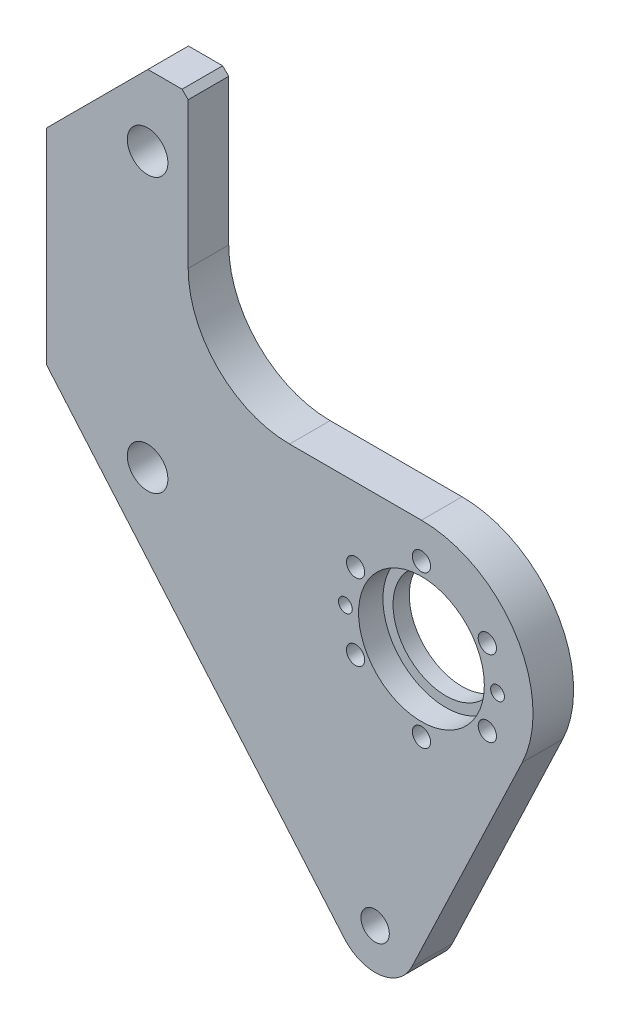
ISO-10303-21;
HEADER;
FILE_DESCRIPTION(('STEP AP214'),'2;1');
FILE_NAME('part.step','',(''),(''),'','','');
FILE_SCHEMA(('AUTOMOTIVE_DESIGN { 1 0 10303 214 1 1 1 1 }'));
ENDSEC;
DATA;
#1=APPLICATION_CONTEXT('core data for automotive mechanical design processes');
#2=APPLICATION_PROTOCOL_DEFINITION('international standard','automotive_design',2000,#1);
#3=PRODUCT_CONTEXT('',#1,'mechanical');
#4=PRODUCT('Part','Part','',(#3));
#5=PRODUCT_RELATED_PRODUCT_CATEGORY('part','',(#4));
#6=PRODUCT_DEFINITION_FORMATION('','',#4);
#7=PRODUCT_DEFINITION_CONTEXT('part definition',#1,'design');
#8=PRODUCT_DEFINITION('design','',#6,#7);
#9=PRODUCT_DEFINITION_SHAPE('','',#8);
#10=(LENGTH_UNIT() NAMED_UNIT(*) SI_UNIT(.MILLI.,.METRE.));
#11=(NAMED_UNIT(*) PLANE_ANGLE_UNIT() SI_UNIT($,.RADIAN.));
#12=(NAMED_UNIT(*) SI_UNIT($,.STERADIAN.) SOLID_ANGLE_UNIT());
#13=UNCERTAINTY_MEASURE_WITH_UNIT(LENGTH_MEASURE(1.E-05),#10,'distance_accuracy_value','');
#14=(GEOMETRIC_REPRESENTATION_CONTEXT(3) GLOBAL_UNCERTAINTY_ASSIGNED_CONTEXT((#13)) GLOBAL_UNIT_ASSIGNED_CONTEXT((#10,
#11,#12)) REPRESENTATION_CONTEXT('',''));
#15=CARTESIAN_POINT('',(0.,0.,0.));
#16=DIRECTION('',(0.,0.,1.));
#17=DIRECTION('',(1.,0.,0.));
#18=AXIS2_PLACEMENT_3D('',#15,#16,#17);
#19=CARTESIAN_POINT('',(0.,0.,-20.));
#20=DIRECTION('',(0.,0.,1.));
#21=DIRECTION('',(1.,0.,0.));
#22=AXIS2_PLACEMENT_3D('',#19,#20,#21);
#23=CYLINDRICAL_SURFACE('',#22,26.);
#24=CARTESIAN_POINT('',(0.,0.,-20.));
#25=DIRECTION('',(0.,0.,1.));
#26=DIRECTION('',(1.,0.,0.));
#27=AXIS2_PLACEMENT_3D('',#24,#25,#26);
#28=CIRCLE('',#27,26.);
#29=CARTESIAN_POINT('',(26.,0.,-20.));
#30=VERTEX_POINT('',#29);
#31=EDGE_CURVE('E455',#30,#30,#28,.T.);
#32=ORIENTED_EDGE('',*,*,#31,.F.);
#33=EDGE_LOOP('',(#32));
#34=FACE_BOUND('',#33,.T.);
#35=CARTESIAN_POINT('',(0.,0.,-12.));
#36=DIRECTION('',(0.,0.,1.));
#37=DIRECTION('',(1.,0.,0.));
#38=AXIS2_PLACEMENT_3D('',#35,#36,#37);
#39=CIRCLE('',#38,26.);
#40=CARTESIAN_POINT('',(26.,0.,-12.));
#41=VERTEX_POINT('',#40);
#42=EDGE_CURVE('E352',#41,#41,#39,.F.);
#43=ORIENTED_EDGE('',*,*,#42,.F.);
#44=EDGE_LOOP('',(#43));
#45=FACE_BOUND('',#44,.T.);
#46=ADVANCED_FACE('F348',(#34,#45),#23,.F.);
#47=CARTESIAN_POINT('',(-65.,105.,-20.));
#48=DIRECTION('',(0.,0.,1.));
#49=DIRECTION('',(1.,0.,0.));
#50=AXIS2_PLACEMENT_3D('',#47,#48,#49);
#51=CYLINDRICAL_SURFACE('',#50,50.);
#52=CARTESIAN_POINT('',(-65.,105.,0.));
#53=DIRECTION('',(0.,0.,-1.));
#54=DIRECTION('',(-1.,0.,0.));
#55=AXIS2_PLACEMENT_3D('',#52,#53,#54);
#56=CIRCLE('',#55,50.);
#57=CARTESIAN_POINT('',(-65.,55.,0.));
#58=VERTEX_POINT('',#57);
#59=CARTESIAN_POINT('',(-115.,105.,0.));
#60=VERTEX_POINT('',#59);
#61=EDGE_CURVE('E434',#58,#60,#56,.T.);
#62=ORIENTED_EDGE('',*,*,#61,.F.);
#63=DIRECTION('',(0.,0.,1.));
#64=VECTOR('',#63,1.);
#65=CARTESIAN_POINT('',(-65.,55.,-20.));
#66=LINE('',#65,#64);
#67=CARTESIAN_POINT('',(-65.,55.,-20.));
#68=VERTEX_POINT('',#67);
#69=EDGE_CURVE('E506',#68,#58,#66,.T.);
#70=ORIENTED_EDGE('',*,*,#69,.F.);
#71=CARTESIAN_POINT('',(-65.,105.,-20.));
#72=DIRECTION('',(0.,0.,-1.));
#73=DIRECTION('',(-1.,0.,0.));
#74=AXIS2_PLACEMENT_3D('',#71,#72,#73);
#75=CIRCLE('',#74,50.);
#76=CARTESIAN_POINT('',(-115.,105.,-20.));
#77=VERTEX_POINT('',#76);
#78=EDGE_CURVE('E437',#68,#77,#75,.T.);
#79=ORIENTED_EDGE('',*,*,#78,.T.);
#80=DIRECTION('',(0.,0.,1.));
#81=VECTOR('',#80,1.);
#82=CARTESIAN_POINT('',(-115.,105.,-20.));
#83=LINE('',#82,#81);
#84=EDGE_CURVE('E431',#77,#60,#83,.T.);
#85=ORIENTED_EDGE('',*,*,#84,.T.);
#86=EDGE_LOOP('',(#62,#70,#79,#85));
#87=FACE_BOUND('',#86,.T.);
#88=ADVANCED_FACE('F350',(#87),#51,.F.);
#89=CARTESIAN_POINT('',(-65.,55.,-20.));
#90=DIRECTION('',(0.,1.,0.));
#91=DIRECTION('',(0.,0.,1.));
#92=AXIS2_PLACEMENT_3D('',#89,#90,#91);
#93=PLANE('',#92);
#94=DIRECTION('',(-1.,0.,0.));
#95=VECTOR('',#94,1.);
#96=CARTESIAN_POINT('',(-65.,55.,0.));
#97=LINE('',#96,#95);
#98=CARTESIAN_POINT('',(0.,55.,0.));
#99=VERTEX_POINT('',#98);
#100=EDGE_CURVE('E454',#99,#58,#97,.T.);
#101=ORIENTED_EDGE('',*,*,#100,.F.);
#102=DIRECTION('',(0.,0.,1.));
#103=VECTOR('',#102,1.);
#104=CARTESIAN_POINT('',(0.,55.,-20.));
#105=LINE('',#104,#103);
#106=CARTESIAN_POINT('',(0.,55.,-20.));
#107=VERTEX_POINT('',#106);
#108=EDGE_CURVE('E508',#107,#99,#105,.T.);
#109=ORIENTED_EDGE('',*,*,#108,.F.);
#110=DIRECTION('',(-1.,0.,0.));
#111=VECTOR('',#110,1.);
#112=CARTESIAN_POINT('',(-65.,55.,-20.));
#113=LINE('',#112,#111);
#114=EDGE_CURVE('E442',#107,#68,#113,.T.);
#115=ORIENTED_EDGE('',*,*,#114,.T.);
#116=ORIENTED_EDGE('',*,*,#69,.T.);
#117=EDGE_LOOP('',(#101,#109,#115,#116));
#118=FACE_BOUND('',#117,.T.);
#119=ADVANCED_FACE('F623',(#118),#93,.T.);
#120=CARTESIAN_POINT('',(0.,0.,-20.));
#121=DIRECTION('',(0.,0.,1.));
#122=DIRECTION('',(1.,0.,0.));
#123=AXIS2_PLACEMENT_3D('',#120,#121,#122);
#124=CYLINDRICAL_SURFACE('',#123,55.);
#125=CARTESIAN_POINT('',(0.,0.,0.));
#126=DIRECTION('',(0.,0.,1.));
#127=DIRECTION('',(1.,0.,0.));
#128=AXIS2_PLACEMENT_3D('',#125,#126,#127);
#129=CIRCLE('',#128,55.);
#130=CARTESIAN_POINT('',(49.6691976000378,-23.6214057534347,0.));
#131=VERTEX_POINT('',#130);
#132=EDGE_CURVE('E478',#131,#99,#129,.T.);
#133=ORIENTED_EDGE('',*,*,#132,.F.);
#134=DIRECTION('',(0.,0.,1.));
#135=VECTOR('',#134,1.);
#136=CARTESIAN_POINT('',(49.6691976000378,-23.6214057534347,-20.));
#137=LINE('',#136,#135);
#138=CARTESIAN_POINT('',(49.6691976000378,-23.6214057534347,-20.));
#139=VERTEX_POINT('',#138);
#140=EDGE_CURVE('E510',#139,#131,#137,.T.);
#141=ORIENTED_EDGE('',*,*,#140,.F.);
#142=CARTESIAN_POINT('',(0.,0.,-20.));
#143=DIRECTION('',(0.,0.,1.));
#144=DIRECTION('',(1.,0.,0.));
#145=AXIS2_PLACEMENT_3D('',#142,#143,#144);
#146=CIRCLE('',#145,55.);
#147=EDGE_CURVE('E501',#139,#107,#146,.T.);
#148=ORIENTED_EDGE('',*,*,#147,.T.);
#149=ORIENTED_EDGE('',*,*,#108,.T.);
#150=EDGE_LOOP('',(#133,#141,#148,#149));
#151=FACE_BOUND('',#150,.T.);
#152=ADVANCED_FACE('F799',(#151),#124,.T.);
#153=CARTESIAN_POINT('',(49.6691976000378,-23.6214057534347,-20.));
#154=DIRECTION('',(0.903076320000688,-0.429480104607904,0.));
#155=DIRECTION('',(0.429480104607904,0.903076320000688,0.));
#156=AXIS2_PLACEMENT_3D('',#153,#154,#155);
#157=PLANE('',#156);
#158=DIRECTION('',(0.429480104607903,0.903076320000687,0.));
#159=VECTOR('',#158,1.);
#160=CARTESIAN_POINT('',(49.6691976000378,-23.6214057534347,0.));
#161=LINE('',#160,#159);
#162=CARTESIAN_POINT('',(-4.77847359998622,-138.109602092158,0.));
#163=VERTEX_POINT('',#162);
#164=EDGE_CURVE('E475',#163,#131,#161,.T.);
#165=ORIENTED_EDGE('',*,*,#164,.F.);
#166=DIRECTION('',(0.,0.,1.));
#167=VECTOR('',#166,1.);
#168=CARTESIAN_POINT('',(-4.77847359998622,-138.109602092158,-20.));
#169=LINE('',#168,#167);
#170=CARTESIAN_POINT('',(-4.77847359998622,-138.109602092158,-20.));
#171=VERTEX_POINT('',#170);
#172=EDGE_CURVE('E512',#171,#163,#169,.T.);
#173=ORIENTED_EDGE('',*,*,#172,.F.);
#174=DIRECTION('',(0.429480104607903,0.903076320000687,0.));
#175=VECTOR('',#174,1.);
#176=CARTESIAN_POINT('',(49.6691976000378,-23.6214057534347,-20.));
#177=LINE('',#176,#175);
#178=EDGE_CURVE('E498',#171,#139,#177,.T.);
#179=ORIENTED_EDGE('',*,*,#178,.T.);
#180=ORIENTED_EDGE('',*,*,#140,.T.);
#181=EDGE_LOOP('',(#165,#173,#179,#180));
#182=FACE_BOUND('',#181,.T.);
#183=ADVANCED_FACE('F791',(#182),#157,.T.);
#184=CARTESIAN_POINT('',(-22.84,-129.52,-20.));
#185=DIRECTION('',(0.,0.,1.));
#186=DIRECTION('',(1.,0.,0.));
#187=AXIS2_PLACEMENT_3D('',#184,#185,#186);
#188=CYLINDRICAL_SURFACE('',#187,20.);
#189=CARTESIAN_POINT('',(-22.84,-129.52,0.));
#190=DIRECTION('',(0.,0.,1.));
#191=DIRECTION('',(1.,0.,0.));
#192=AXIS2_PLACEMENT_3D('',#189,#190,#191);
#193=CIRCLE('',#192,20.);
#194=CARTESIAN_POINT('',(-38.033276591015,-142.526319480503,0.));
#195=VERTEX_POINT('',#194);
#196=EDGE_CURVE('E472',#195,#163,#193,.T.);
#197=ORIENTED_EDGE('',*,*,#196,.F.);
#198=DIRECTION('',(0.,0.,1.));
#199=VECTOR('',#198,1.);
#200=CARTESIAN_POINT('',(-38.033276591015,-142.526319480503,-20.));
#201=LINE('',#200,#199);
#202=CARTESIAN_POINT('',(-38.033276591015,-142.526319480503,-20.));
#203=VERTEX_POINT('',#202);
#204=EDGE_CURVE('E514',#203,#195,#201,.T.);
#205=ORIENTED_EDGE('',*,*,#204,.F.);
#206=CARTESIAN_POINT('',(-22.84,-129.52,-20.));
#207=DIRECTION('',(0.,0.,1.));
#208=DIRECTION('',(1.,0.,0.));
#209=AXIS2_PLACEMENT_3D('',#206,#207,#208);
#210=CIRCLE('',#209,20.);
#211=EDGE_CURVE('E495',#203,#171,#210,.T.);
#212=ORIENTED_EDGE('',*,*,#211,.T.);
#213=ORIENTED_EDGE('',*,*,#172,.T.);
#214=EDGE_LOOP('',(#197,#205,#212,#213));
#215=FACE_BOUND('',#214,.T.);
#216=ADVANCED_FACE('F783',(#215),#188,.T.);
#217=CARTESIAN_POINT('',(-38.033276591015,-142.526319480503,-20.));
#218=DIRECTION('',(-0.759663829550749,-0.650315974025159,0.));
#219=DIRECTION('',(0.650315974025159,-0.759663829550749,0.));
#220=AXIS2_PLACEMENT_3D('',#217,#218,#219);
#221=PLANE('',#220);
#222=DIRECTION('',(0.650315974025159,-0.759663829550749,0.));
#223=VECTOR('',#222,1.);
#224=CARTESIAN_POINT('',(-38.033276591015,-142.526319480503,0.));
#225=LINE('',#224,#223);
#226=CARTESIAN_POINT('',(-184.869681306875,29.,0.));
#227=VERTEX_POINT('',#226);
#228=EDGE_CURVE('E469',#227,#195,#225,.T.);
#229=ORIENTED_EDGE('',*,*,#228,.F.);
#230=DIRECTION('',(0.,0.,1.));
#231=VECTOR('',#230,1.);
#232=CARTESIAN_POINT('',(-184.869681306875,29.,-20.));
#233=LINE('',#232,#231);
#234=CARTESIAN_POINT('',(-184.869681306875,29.,-20.));
#235=VERTEX_POINT('',#234);
#236=EDGE_CURVE('E516',#235,#227,#233,.T.);
#237=ORIENTED_EDGE('',*,*,#236,.F.);
#238=DIRECTION('',(0.650315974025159,-0.759663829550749,0.));
#239=VECTOR('',#238,1.);
#240=CARTESIAN_POINT('',(-38.033276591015,-142.526319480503,-20.));
#241=LINE('',#240,#239);
#242=EDGE_CURVE('E492',#235,#203,#241,.T.);
#243=ORIENTED_EDGE('',*,*,#242,.T.);
#244=ORIENTED_EDGE('',*,*,#204,.T.);
#245=EDGE_LOOP('',(#229,#237,#243,#244));
#246=FACE_BOUND('',#245,.T.);
#247=ADVANCED_FACE('F775',(#246),#221,.T.);
#248=CARTESIAN_POINT('',(-184.869681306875,29.,-20.));
#249=DIRECTION('',(-1.,0.,0.));
#250=DIRECTION('',(0.,-1.,0.));
#251=AXIS2_PLACEMENT_3D('',#248,#249,#250);
#252=PLANE('',#251);
#253=DIRECTION('',(0.,-1.,0.));
#254=VECTOR('',#253,1.);
#255=CARTESIAN_POINT('',(-184.869681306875,29.,0.));
#256=LINE('',#255,#254);
#257=CARTESIAN_POINT('',(-184.869681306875,130.,0.));
#258=VERTEX_POINT('',#257);
#259=EDGE_CURVE('E466',#258,#227,#256,.T.);
#260=ORIENTED_EDGE('',*,*,#259,.F.);
#261=DIRECTION('',(0.,0.,1.));
#262=VECTOR('',#261,1.);
#263=CARTESIAN_POINT('',(-184.869681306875,130.,-20.));
#264=LINE('',#263,#262);
#265=CARTESIAN_POINT('',(-184.869681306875,130.,-20.));
#266=VERTEX_POINT('',#265);
#267=EDGE_CURVE('E518',#266,#258,#264,.T.);
#268=ORIENTED_EDGE('',*,*,#267,.F.);
#269=DIRECTION('',(0.,-1.,0.));
#270=VECTOR('',#269,1.);
#271=CARTESIAN_POINT('',(-184.869681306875,29.,-20.));
#272=LINE('',#271,#270);
#273=EDGE_CURVE('E489',#266,#235,#272,.T.);
#274=ORIENTED_EDGE('',*,*,#273,.T.);
#275=ORIENTED_EDGE('',*,*,#236,.T.);
#276=EDGE_LOOP('',(#260,#268,#274,#275));
#277=FACE_BOUND('',#276,.T.);
#278=ADVANCED_FACE('F767',(#277),#252,.T.);
#279=CARTESIAN_POINT('',(-184.869681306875,130.,-20.));
#280=DIRECTION('',(-0.707106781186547,0.707106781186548,0.));
#281=DIRECTION('',(-0.707106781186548,-0.707106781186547,0.));
#282=AXIS2_PLACEMENT_3D('',#279,#280,#281);
#283=PLANE('',#282);
#284=DIRECTION('',(-0.707106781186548,-0.707106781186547,0.));
#285=VECTOR('',#284,1.);
#286=CARTESIAN_POINT('',(-184.869681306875,130.,0.));
#287=LINE('',#286,#285);
#288=CARTESIAN_POINT('',(-134.869681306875,180.,0.));
#289=VERTEX_POINT('',#288);
#290=EDGE_CURVE('E463',#289,#258,#287,.T.);
#291=ORIENTED_EDGE('',*,*,#290,.F.);
#292=DIRECTION('',(0.,0.,1.));
#293=VECTOR('',#292,1.);
#294=CARTESIAN_POINT('',(-134.869681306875,180.,-20.));
#295=LINE('',#294,#293);
#296=CARTESIAN_POINT('',(-134.869681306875,180.,-20.));
#297=VERTEX_POINT('',#296);
#298=EDGE_CURVE('E441',#297,#289,#295,.T.);
#299=ORIENTED_EDGE('',*,*,#298,.F.);
#300=DIRECTION('',(-0.707106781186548,-0.707106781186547,0.));
#301=VECTOR('',#300,1.);
#302=CARTESIAN_POINT('',(-184.869681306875,130.,-20.));
#303=LINE('',#302,#301);
#304=EDGE_CURVE('E486',#297,#266,#303,.T.);
#305=ORIENTED_EDGE('',*,*,#304,.T.);
#306=ORIENTED_EDGE('',*,*,#267,.T.);
#307=EDGE_LOOP('',(#291,#299,#305,#306));
#308=FACE_BOUND('',#307,.T.);
#309=ADVANCED_FACE('F760',(#308),#283,.T.);
#310=CARTESIAN_POINT('',(-134.869681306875,180.,-20.));
#311=DIRECTION('',(0.,1.,0.));
#312=DIRECTION('',(0.,0.,1.));
#313=AXIS2_PLACEMENT_3D('',#310,#311,#312);
#314=PLANE('',#313);
#315=DIRECTION('',(-1.,0.,0.));
#316=VECTOR('',#315,1.);
#317=CARTESIAN_POINT('',(-134.869681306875,180.,0.));
#318=LINE('',#317,#316);
#319=CARTESIAN_POINT('',(-118.,180.,0.));
#320=VERTEX_POINT('',#319);
#321=EDGE_CURVE('E449',#320,#289,#318,.T.);
#322=ORIENTED_EDGE('',*,*,#321,.F.);
#323=DIRECTION('',(0.,0.,-1.));
#324=VECTOR('',#323,1.);
#325=CARTESIAN_POINT('',(-118.,180.,-20.));
#326=LINE('',#325,#324);
#327=CARTESIAN_POINT('',(-118.,180.,-20.));
#328=VERTEX_POINT('',#327);
#329=EDGE_CURVE('E357',#320,#328,#326,.T.);
#330=ORIENTED_EDGE('',*,*,#329,.T.);
#331=DIRECTION('',(-1.,0.,0.));
#332=VECTOR('',#331,1.);
#333=CARTESIAN_POINT('',(-134.869681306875,180.,-20.));
#334=LINE('',#333,#332);
#335=EDGE_CURVE('E484',#328,#297,#334,.T.);
#336=ORIENTED_EDGE('',*,*,#335,.T.);
#337=ORIENTED_EDGE('',*,*,#298,.T.);
#338=EDGE_LOOP('',(#322,#330,#336,#337));
#339=FACE_BOUND('',#338,.T.);
#340=ADVANCED_FACE('F754',(#339),#314,.T.);
#341=CARTESIAN_POINT('',(-115.,105.,-20.));
#342=DIRECTION('',(1.,0.,0.));
#343=DIRECTION('',(0.,1.,0.));
#344=AXIS2_PLACEMENT_3D('',#341,#342,#343);
#345=PLANE('',#344);
#346=DIRECTION('',(0.,1.,0.));
#347=VECTOR('',#346,1.);
#348=CARTESIAN_POINT('',(-115.,105.,-20.));
#349=LINE('',#348,#347);
#350=CARTESIAN_POINT('',(-115.,177.,-20.));
#351=VERTEX_POINT('',#350);
#352=EDGE_CURVE('E482',#77,#351,#349,.T.);
#353=ORIENTED_EDGE('',*,*,#352,.T.);
#354=DIRECTION('',(0.,0.,1.));
#355=VECTOR('',#354,1.);
#356=CARTESIAN_POINT('',(-115.,177.,-20.));
#357=LINE('',#356,#355);
#358=CARTESIAN_POINT('',(-115.,177.,0.));
#359=VERTEX_POINT('',#358);
#360=EDGE_CURVE('E448',#351,#359,#357,.T.);
#361=ORIENTED_EDGE('',*,*,#360,.T.);
#362=DIRECTION('',(0.,1.,0.));
#363=VECTOR('',#362,1.);
#364=CARTESIAN_POINT('',(-115.,105.,0.));
#365=LINE('',#364,#363);
#366=EDGE_CURVE('E445',#60,#359,#365,.T.);
#367=ORIENTED_EDGE('',*,*,#366,.F.);
#368=ORIENTED_EDGE('',*,*,#84,.F.);
#369=EDGE_LOOP('',(#353,#361,#367,#368));
#370=FACE_BOUND('',#369,.T.);
#371=ADVANCED_FACE('F446',(#370),#345,.T.);
#372=CARTESIAN_POINT('',(-65.,105.,-20.));
#373=DIRECTION('',(0.,0.,-1.));
#374=DIRECTION('',(-1.,0.,0.));
#375=AXIS2_PLACEMENT_3D('',#372,#373,#374);
#376=PLANE('',#375);
#377=CARTESIAN_POINT('',(-37.5,0.,-20.));
#378=DIRECTION('',(0.,0.,-1.));
#379=DIRECTION('',(-1.,0.,0.));
#380=AXIS2_PLACEMENT_3D('',#377,#378,#379);
#381=CIRCLE('',#380,3.39999999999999);
#382=CARTESIAN_POINT('',(-40.9,0.,-20.));
#383=VERTEX_POINT('',#382);
#384=EDGE_CURVE('E529',#383,#383,#381,.T.);
#385=ORIENTED_EDGE('',*,*,#384,.F.);
#386=EDGE_LOOP('',(#385));
#387=FACE_BOUND('',#386,.T.);
#388=CARTESIAN_POINT('',(37.5,0.,-20.));
#389=DIRECTION('',(0.,0.,-1.));
#390=DIRECTION('',(-1.,0.,0.));
#391=AXIS2_PLACEMENT_3D('',#388,#389,#390);
#392=CIRCLE('',#391,3.39999999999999);
#393=CARTESIAN_POINT('',(34.1,0.,-20.));
#394=VERTEX_POINT('',#393);
#395=EDGE_CURVE('E525',#394,#394,#392,.T.);
#396=ORIENTED_EDGE('',*,*,#395,.F.);
#397=EDGE_LOOP('',(#396));
#398=FACE_BOUND('',#397,.T.);
#399=CARTESIAN_POINT('',(0.,37.5,-20.));
#400=DIRECTION('',(0.,0.,1.));
#401=DIRECTION('',(1.,0.,0.));
#402=AXIS2_PLACEMENT_3D('',#399,#400,#401);
#403=CIRCLE('',#402,4.5);
#404=CARTESIAN_POINT('',(4.5,37.5,-20.));
#405=VERTEX_POINT('',#404);
#406=EDGE_CURVE('E547',#405,#405,#403,.T.);
#407=ORIENTED_EDGE('',*,*,#406,.T.);
#408=EDGE_LOOP('',(#407));
#409=FACE_BOUND('',#408,.T.);
#410=CARTESIAN_POINT('',(-32.4759526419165,18.7499999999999,-20.));
#411=DIRECTION('',(0.,0.,1.));
#412=DIRECTION('',(1.,0.,0.));
#413=AXIS2_PLACEMENT_3D('',#410,#411,#412);
#414=CIRCLE('',#413,4.5);
#415=CARTESIAN_POINT('',(-27.9759526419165,18.7499999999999,-20.));
#416=VERTEX_POINT('',#415);
#417=EDGE_CURVE('E553',#416,#416,#414,.T.);
#418=ORIENTED_EDGE('',*,*,#417,.T.);
#419=EDGE_LOOP('',(#418));
#420=FACE_BOUND('',#419,.T.);
#421=CARTESIAN_POINT('',(-32.4759526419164,-18.7500000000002,-20.));
#422=DIRECTION('',(0.,0.,1.));
#423=DIRECTION('',(1.,0.,0.));
#424=AXIS2_PLACEMENT_3D('',#421,#422,#423);
#425=CIRCLE('',#424,4.5);
#426=CARTESIAN_POINT('',(-27.9759526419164,-18.7500000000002,-20.));
#427=VERTEX_POINT('',#426);
#428=EDGE_CURVE('E559',#427,#427,#425,.T.);
#429=ORIENTED_EDGE('',*,*,#428,.T.);
#430=EDGE_LOOP('',(#429));
#431=FACE_BOUND('',#430,.T.);
#432=CARTESIAN_POINT('',(0.,-37.5,-20.));
#433=DIRECTION('',(0.,0.,1.));
#434=DIRECTION('',(1.,0.,0.));
#435=AXIS2_PLACEMENT_3D('',#432,#433,#434);
#436=CIRCLE('',#435,4.5);
#437=CARTESIAN_POINT('',(4.5,-37.5,-20.));
#438=VERTEX_POINT('',#437);
#439=EDGE_CURVE('E565',#438,#438,#436,.T.);
#440=ORIENTED_EDGE('',*,*,#439,.T.);
#441=EDGE_LOOP('',(#440));
#442=FACE_BOUND('',#441,.T.);
#443=CARTESIAN_POINT('',(32.4759526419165,-18.7499999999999,-20.));
#444=DIRECTION('',(0.,0.,1.));
#445=DIRECTION('',(1.,0.,0.));
#446=AXIS2_PLACEMENT_3D('',#443,#444,#445);
#447=CIRCLE('',#446,4.5);
#448=CARTESIAN_POINT('',(36.9759526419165,-18.7499999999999,-20.));
#449=VERTEX_POINT('',#448);
#450=EDGE_CURVE('E571',#449,#449,#447,.T.);
#451=ORIENTED_EDGE('',*,*,#450,.T.);
#452=EDGE_LOOP('',(#451));
#453=FACE_BOUND('',#452,.T.);
#454=CARTESIAN_POINT('',(32.4759526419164,18.7500000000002,-20.));
#455=DIRECTION('',(0.,0.,1.));
#456=DIRECTION('',(1.,0.,0.));
#457=AXIS2_PLACEMENT_3D('',#454,#455,#456);
#458=CIRCLE('',#457,4.5);
#459=CARTESIAN_POINT('',(36.9759526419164,18.7500000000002,-20.));
#460=VERTEX_POINT('',#459);
#461=EDGE_CURVE('E577',#460,#460,#458,.T.);
#462=ORIENTED_EDGE('',*,*,#461,.T.);
#463=EDGE_LOOP('',(#462));
#464=FACE_BOUND('',#463,.T.);
#465=CARTESIAN_POINT('',(-22.84,-129.52,-20.));
#466=DIRECTION('',(0.,0.,1.));
#467=DIRECTION('',(1.,0.,0.));
#468=AXIS2_PLACEMENT_3D('',#465,#466,#467);
#469=CIRCLE('',#468,6.99999999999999);
#470=CARTESIAN_POINT('',(-15.84,-129.52,-20.));
#471=VERTEX_POINT('',#470);
#472=EDGE_CURVE('E583',#471,#471,#469,.T.);
#473=ORIENTED_EDGE('',*,*,#472,.T.);
#474=EDGE_LOOP('',(#473));
#475=FACE_BOUND('',#474,.T.);
#476=CARTESIAN_POINT('',(-135.,145.,-20.));
#477=DIRECTION('',(0.,0.,1.));
#478=DIRECTION('',(1.,0.,0.));
#479=AXIS2_PLACEMENT_3D('',#476,#477,#478);
#480=CIRCLE('',#479,10.);
#481=CARTESIAN_POINT('',(-125.,145.,-20.));
#482=VERTEX_POINT('',#481);
#483=EDGE_CURVE('E589',#482,#482,#480,.T.);
#484=ORIENTED_EDGE('',*,*,#483,.T.);
#485=EDGE_LOOP('',(#484));
#486=FACE_BOUND('',#485,.T.);
#487=CARTESIAN_POINT('',(-135.,9.99999999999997,-20.));
#488=DIRECTION('',(0.,0.,1.));
#489=DIRECTION('',(1.,0.,0.));
#490=AXIS2_PLACEMENT_3D('',#487,#488,#489);
#491=CIRCLE('',#490,10.);
#492=CARTESIAN_POINT('',(-125.,9.99999999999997,-20.));
#493=VERTEX_POINT('',#492);
#494=EDGE_CURVE('E458',#493,#493,#491,.T.);
#495=ORIENTED_EDGE('',*,*,#494,.T.);
#496=EDGE_LOOP('',(#495));
#497=FACE_BOUND('',#496,.T.);
#498=ORIENTED_EDGE('',*,*,#31,.T.);
#499=EDGE_LOOP('',(#498));
#500=FACE_BOUND('',#499,.T.);
#501=ORIENTED_EDGE('',*,*,#335,.F.);
#502=DIRECTION('',(-0.707106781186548,0.707106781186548,0.));
#503=VECTOR('',#502,1.);
#504=CARTESIAN_POINT('',(-54.,116.,-20.));
#505=LINE('',#504,#503);
#506=EDGE_CURVE('E11',#328,#351,#505,.F.);
#507=ORIENTED_EDGE('',*,*,#506,.T.);
#508=ORIENTED_EDGE('',*,*,#352,.F.);
#509=ORIENTED_EDGE('',*,*,#78,.F.);
#510=ORIENTED_EDGE('',*,*,#114,.F.);
#511=ORIENTED_EDGE('',*,*,#147,.F.);
#512=ORIENTED_EDGE('',*,*,#178,.F.);
#513=ORIENTED_EDGE('',*,*,#211,.F.);
#514=ORIENTED_EDGE('',*,*,#242,.F.);
#515=ORIENTED_EDGE('',*,*,#273,.F.);
#516=ORIENTED_EDGE('',*,*,#304,.F.);
#517=EDGE_LOOP('',(#501,#507,#508,#509,#510,#511,#512,#513,#514,#515,#516));
#518=FACE_BOUND('',#517,.T.);
#519=ADVANCED_FACE('F597',(#387,#398,#409,#420,#431,#442,#453,#464,#475,#486,#497,#500,#518),
#376,.T.);
#520=CARTESIAN_POINT('',(-65.,105.,0.));
#521=DIRECTION('',(0.,0.,-1.));
#522=DIRECTION('',(-1.,0.,0.));
#523=AXIS2_PLACEMENT_3D('',#520,#521,#522);
#524=PLANE('',#523);
#525=CARTESIAN_POINT('',(0.,0.,0.));
#526=DIRECTION('',(0.,0.,1.));
#527=DIRECTION('',(1.,0.,0.));
#528=AXIS2_PLACEMENT_3D('',#525,#526,#527);
#529=CIRCLE('',#528,31.);
#530=CARTESIAN_POINT('',(31.,0.,0.));
#531=VERTEX_POINT('',#530);
#532=EDGE_CURVE('E683',#531,#531,#529,.T.);
#533=ORIENTED_EDGE('',*,*,#532,.F.);
#534=EDGE_LOOP('',(#533));
#535=FACE_BOUND('',#534,.T.);
#536=CARTESIAN_POINT('',(-37.5,0.,0.));
#537=DIRECTION('',(0.,0.,1.));
#538=DIRECTION('',(1.,0.,0.));
#539=AXIS2_PLACEMENT_3D('',#536,#537,#538);
#540=CIRCLE('',#539,3.39999999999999);
#541=CARTESIAN_POINT('',(-34.1,0.,0.));
#542=VERTEX_POINT('',#541);
#543=EDGE_CURVE('E531',#542,#542,#540,.T.);
#544=ORIENTED_EDGE('',*,*,#543,.F.);
#545=EDGE_LOOP('',(#544));
#546=FACE_BOUND('',#545,.T.);
#547=CARTESIAN_POINT('',(37.5,0.,0.));
#548=DIRECTION('',(0.,0.,1.));
#549=DIRECTION('',(1.,0.,0.));
#550=AXIS2_PLACEMENT_3D('',#547,#548,#549);
#551=CIRCLE('',#550,3.39999999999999);
#552=CARTESIAN_POINT('',(40.9,0.,0.));
#553=VERTEX_POINT('',#552);
#554=EDGE_CURVE('E528',#553,#553,#551,.T.);
#555=ORIENTED_EDGE('',*,*,#554,.F.);
#556=EDGE_LOOP('',(#555));
#557=FACE_BOUND('',#556,.T.);
#558=CARTESIAN_POINT('',(0.,37.5,0.));
#559=DIRECTION('',(0.,0.,1.));
#560=DIRECTION('',(1.,0.,0.));
#561=AXIS2_PLACEMENT_3D('',#558,#559,#560);
#562=CIRCLE('',#561,4.5);
#563=CARTESIAN_POINT('',(4.5,37.5,0.));
#564=VERTEX_POINT('',#563);
#565=EDGE_CURVE('E527',#564,#564,#562,.T.);
#566=ORIENTED_EDGE('',*,*,#565,.F.);
#567=EDGE_LOOP('',(#566));
#568=FACE_BOUND('',#567,.T.);
#569=CARTESIAN_POINT('',(-32.4759526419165,18.7499999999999,0.));
#570=DIRECTION('',(0.,0.,1.));
#571=DIRECTION('',(1.,0.,0.));
#572=AXIS2_PLACEMENT_3D('',#569,#570,#571);
#573=CIRCLE('',#572,4.5);
#574=CARTESIAN_POINT('',(-27.9759526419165,18.7499999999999,0.));
#575=VERTEX_POINT('',#574);
#576=EDGE_CURVE('E550',#575,#575,#573,.T.);
#577=ORIENTED_EDGE('',*,*,#576,.F.);
#578=EDGE_LOOP('',(#577));
#579=FACE_BOUND('',#578,.T.);
#580=CARTESIAN_POINT('',(-32.4759526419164,-18.7500000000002,0.));
#581=DIRECTION('',(0.,0.,1.));
#582=DIRECTION('',(1.,0.,0.));
#583=AXIS2_PLACEMENT_3D('',#580,#581,#582);
#584=CIRCLE('',#583,4.5);
#585=CARTESIAN_POINT('',(-27.9759526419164,-18.7500000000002,0.));
#586=VERTEX_POINT('',#585);
#587=EDGE_CURVE('E556',#586,#586,#584,.T.);
#588=ORIENTED_EDGE('',*,*,#587,.F.);
#589=EDGE_LOOP('',(#588));
#590=FACE_BOUND('',#589,.T.);
#591=CARTESIAN_POINT('',(0.,-37.5,0.));
#592=DIRECTION('',(0.,0.,1.));
#593=DIRECTION('',(1.,0.,0.));
#594=AXIS2_PLACEMENT_3D('',#591,#592,#593);
#595=CIRCLE('',#594,4.5);
#596=CARTESIAN_POINT('',(4.5,-37.5,0.));
#597=VERTEX_POINT('',#596);
#598=EDGE_CURVE('E562',#597,#597,#595,.T.);
#599=ORIENTED_EDGE('',*,*,#598,.F.);
#600=EDGE_LOOP('',(#599));
#601=FACE_BOUND('',#600,.T.);
#602=CARTESIAN_POINT('',(32.4759526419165,-18.7499999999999,0.));
#603=DIRECTION('',(0.,0.,1.));
#604=DIRECTION('',(1.,0.,0.));
#605=AXIS2_PLACEMENT_3D('',#602,#603,#604);
#606=CIRCLE('',#605,4.5);
#607=CARTESIAN_POINT('',(36.9759526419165,-18.7499999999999,0.));
#608=VERTEX_POINT('',#607);
#609=EDGE_CURVE('E568',#608,#608,#606,.T.);
#610=ORIENTED_EDGE('',*,*,#609,.F.);
#611=EDGE_LOOP('',(#610));
#612=FACE_BOUND('',#611,.T.);
#613=CARTESIAN_POINT('',(32.4759526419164,18.7500000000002,0.));
#614=DIRECTION('',(0.,0.,1.));
#615=DIRECTION('',(1.,0.,0.));
#616=AXIS2_PLACEMENT_3D('',#613,#614,#615);
#617=CIRCLE('',#616,4.5);
#618=CARTESIAN_POINT('',(36.9759526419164,18.7500000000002,0.));
#619=VERTEX_POINT('',#618);
#620=EDGE_CURVE('E574',#619,#619,#617,.T.);
#621=ORIENTED_EDGE('',*,*,#620,.F.);
#622=EDGE_LOOP('',(#621));
#623=FACE_BOUND('',#622,.T.);
#624=CARTESIAN_POINT('',(-22.84,-129.52,0.));
#625=DIRECTION('',(0.,0.,1.));
#626=DIRECTION('',(1.,0.,0.));
#627=AXIS2_PLACEMENT_3D('',#624,#625,#626);
#628=CIRCLE('',#627,7.);
#629=CARTESIAN_POINT('',(-15.84,-129.52,0.));
#630=VERTEX_POINT('',#629);
#631=EDGE_CURVE('E580',#630,#630,#628,.T.);
#632=ORIENTED_EDGE('',*,*,#631,.F.);
#633=EDGE_LOOP('',(#632));
#634=FACE_BOUND('',#633,.T.);
#635=CARTESIAN_POINT('',(-135.,145.,0.));
#636=DIRECTION('',(0.,0.,1.));
#637=DIRECTION('',(1.,0.,0.));
#638=AXIS2_PLACEMENT_3D('',#635,#636,#637);
#639=CIRCLE('',#638,10.);
#640=CARTESIAN_POINT('',(-125.,145.,0.));
#641=VERTEX_POINT('',#640);
#642=EDGE_CURVE('E586',#641,#641,#639,.T.);
#643=ORIENTED_EDGE('',*,*,#642,.F.);
#644=EDGE_LOOP('',(#643));
#645=FACE_BOUND('',#644,.T.);
#646=CARTESIAN_POINT('',(-135.,9.99999999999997,0.));
#647=DIRECTION('',(0.,0.,1.));
#648=DIRECTION('',(1.,0.,0.));
#649=AXIS2_PLACEMENT_3D('',#646,#647,#648);
#650=CIRCLE('',#649,10.);
#651=CARTESIAN_POINT('',(-125.,9.99999999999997,0.));
#652=VERTEX_POINT('',#651);
#653=EDGE_CURVE('E592',#652,#652,#650,.T.);
#654=ORIENTED_EDGE('',*,*,#653,.F.);
#655=EDGE_LOOP('',(#654));
#656=FACE_BOUND('',#655,.T.);
#657=ORIENTED_EDGE('',*,*,#366,.T.);
#658=DIRECTION('',(0.707106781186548,-0.707106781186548,0.));
#659=VECTOR('',#658,1.);
#660=CARTESIAN_POINT('',(-115.,177.,0.));
#661=LINE('',#660,#659);
#662=EDGE_CURVE('E372',#359,#320,#661,.F.);
#663=ORIENTED_EDGE('',*,*,#662,.T.);
#664=ORIENTED_EDGE('',*,*,#321,.T.);
#665=ORIENTED_EDGE('',*,*,#290,.T.);
#666=ORIENTED_EDGE('',*,*,#259,.T.);
#667=ORIENTED_EDGE('',*,*,#228,.T.);
#668=ORIENTED_EDGE('',*,*,#196,.T.);
#669=ORIENTED_EDGE('',*,*,#164,.T.);
#670=ORIENTED_EDGE('',*,*,#132,.T.);
#671=ORIENTED_EDGE('',*,*,#100,.T.);
#672=ORIENTED_EDGE('',*,*,#61,.T.);
#673=EDGE_LOOP('',(#657,#663,#664,#665,#666,#667,#668,#669,#670,#671,#672));
#674=FACE_BOUND('',#673,.T.);
#675=ADVANCED_FACE('F451',(#535,#546,#557,#568,#579,#590,#601,#612,#623,#634,#645,#656,#674),
#524,.F.);
#676=CARTESIAN_POINT('',(-135.,9.99999999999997,-20.));
#677=DIRECTION('',(0.,0.,1.));
#678=DIRECTION('',(1.,0.,0.));
#679=AXIS2_PLACEMENT_3D('',#676,#677,#678);
#680=CYLINDRICAL_SURFACE('',#679,10.);
#681=ORIENTED_EDGE('',*,*,#494,.F.);
#682=EDGE_LOOP('',(#681));
#683=FACE_BOUND('',#682,.T.);
#684=ORIENTED_EDGE('',*,*,#653,.T.);
#685=EDGE_LOOP('',(#684));
#686=FACE_BOUND('',#685,.T.);
#687=ADVANCED_FACE('F600',(#683,#686),#680,.F.);
#688=CARTESIAN_POINT('',(-135.,145.,-20.));
#689=DIRECTION('',(0.,0.,1.));
#690=DIRECTION('',(1.,0.,0.));
#691=AXIS2_PLACEMENT_3D('',#688,#689,#690);
#692=CYLINDRICAL_SURFACE('',#691,10.);
#693=ORIENTED_EDGE('',*,*,#483,.F.);
#694=EDGE_LOOP('',(#693));
#695=FACE_BOUND('',#694,.T.);
#696=ORIENTED_EDGE('',*,*,#642,.T.);
#697=EDGE_LOOP('',(#696));
#698=FACE_BOUND('',#697,.T.);
#699=ADVANCED_FACE('F603',(#695,#698),#692,.F.);
#700=CARTESIAN_POINT('',(-115.,177.,-20.));
#701=DIRECTION('',(-0.707106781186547,-0.707106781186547,0.));
#702=DIRECTION('',(0.707106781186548,-0.707106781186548,0.));
#703=AXIS2_PLACEMENT_3D('',#700,#701,#702);
#704=PLANE('',#703);
#705=ORIENTED_EDGE('',*,*,#506,.F.);
#706=ORIENTED_EDGE('',*,*,#329,.F.);
#707=ORIENTED_EDGE('',*,*,#662,.F.);
#708=ORIENTED_EDGE('',*,*,#360,.F.);
#709=EDGE_LOOP('',(#705,#706,#707,#708));
#710=FACE_BOUND('',#709,.T.);
#711=ADVANCED_FACE('F629',(#710),#704,.F.);
#712=CARTESIAN_POINT('',(-22.84,-129.52,0.));
#713=DIRECTION('',(0.,0.,1.));
#714=DIRECTION('',(1.,0.,0.));
#715=AXIS2_PLACEMENT_3D('',#712,#713,#714);
#716=CYLINDRICAL_SURFACE('',#715,7.);
#717=ORIENTED_EDGE('',*,*,#472,.F.);
#718=EDGE_LOOP('',(#717));
#719=FACE_BOUND('',#718,.T.);
#720=ORIENTED_EDGE('',*,*,#631,.T.);
#721=EDGE_LOOP('',(#720));
#722=FACE_BOUND('',#721,.T.);
#723=ADVANCED_FACE('F633',(#719,#722),#716,.F.);
#724=CARTESIAN_POINT('',(32.4759526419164,18.7500000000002,-20.));
#725=DIRECTION('',(0.,0.,1.));
#726=DIRECTION('',(1.,0.,0.));
#727=AXIS2_PLACEMENT_3D('',#724,#725,#726);
#728=CYLINDRICAL_SURFACE('',#727,4.5);
#729=ORIENTED_EDGE('',*,*,#461,.F.);
#730=EDGE_LOOP('',(#729));
#731=FACE_BOUND('',#730,.T.);
#732=ORIENTED_EDGE('',*,*,#620,.T.);
#733=EDGE_LOOP('',(#732));
#734=FACE_BOUND('',#733,.T.);
#735=ADVANCED_FACE('F637',(#731,#734),#728,.F.);
#736=CARTESIAN_POINT('',(32.4759526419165,-18.7499999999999,-20.));
#737=DIRECTION('',(0.,0.,1.));
#738=DIRECTION('',(1.,0.,0.));
#739=AXIS2_PLACEMENT_3D('',#736,#737,#738);
#740=CYLINDRICAL_SURFACE('',#739,4.5);
#741=ORIENTED_EDGE('',*,*,#450,.F.);
#742=EDGE_LOOP('',(#741));
#743=FACE_BOUND('',#742,.T.);
#744=ORIENTED_EDGE('',*,*,#609,.T.);
#745=EDGE_LOOP('',(#744));
#746=FACE_BOUND('',#745,.T.);
#747=ADVANCED_FACE('F641',(#743,#746),#740,.F.);
#748=CARTESIAN_POINT('',(0.,-37.5,-20.));
#749=DIRECTION('',(0.,0.,1.));
#750=DIRECTION('',(1.,0.,0.));
#751=AXIS2_PLACEMENT_3D('',#748,#749,#750);
#752=CYLINDRICAL_SURFACE('',#751,4.5);
#753=ORIENTED_EDGE('',*,*,#439,.F.);
#754=EDGE_LOOP('',(#753));
#755=FACE_BOUND('',#754,.T.);
#756=ORIENTED_EDGE('',*,*,#598,.T.);
#757=EDGE_LOOP('',(#756));
#758=FACE_BOUND('',#757,.T.);
#759=ADVANCED_FACE('F645',(#755,#758),#752,.F.);
#760=CARTESIAN_POINT('',(-32.4759526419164,-18.7500000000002,-20.));
#761=DIRECTION('',(0.,0.,1.));
#762=DIRECTION('',(1.,0.,0.));
#763=AXIS2_PLACEMENT_3D('',#760,#761,#762);
#764=CYLINDRICAL_SURFACE('',#763,4.5);
#765=ORIENTED_EDGE('',*,*,#428,.F.);
#766=EDGE_LOOP('',(#765));
#767=FACE_BOUND('',#766,.T.);
#768=ORIENTED_EDGE('',*,*,#587,.T.);
#769=EDGE_LOOP('',(#768));
#770=FACE_BOUND('',#769,.T.);
#771=ADVANCED_FACE('F649',(#767,#770),#764,.F.);
#772=CARTESIAN_POINT('',(-32.4759526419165,18.7499999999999,-20.));
#773=DIRECTION('',(0.,0.,1.));
#774=DIRECTION('',(1.,0.,0.));
#775=AXIS2_PLACEMENT_3D('',#772,#773,#774);
#776=CYLINDRICAL_SURFACE('',#775,4.5);
#777=ORIENTED_EDGE('',*,*,#417,.F.);
#778=EDGE_LOOP('',(#777));
#779=FACE_BOUND('',#778,.T.);
#780=ORIENTED_EDGE('',*,*,#576,.T.);
#781=EDGE_LOOP('',(#780));
#782=FACE_BOUND('',#781,.T.);
#783=ADVANCED_FACE('F653',(#779,#782),#776,.F.);
#784=CARTESIAN_POINT('',(0.,37.5,-20.));
#785=DIRECTION('',(0.,0.,1.));
#786=DIRECTION('',(1.,0.,0.));
#787=AXIS2_PLACEMENT_3D('',#784,#785,#786);
#788=CYLINDRICAL_SURFACE('',#787,4.5);
#789=ORIENTED_EDGE('',*,*,#406,.F.);
#790=EDGE_LOOP('',(#789));
#791=FACE_BOUND('',#790,.T.);
#792=ORIENTED_EDGE('',*,*,#565,.T.);
#793=EDGE_LOOP('',(#792));
#794=FACE_BOUND('',#793,.T.);
#795=ADVANCED_FACE('F657',(#791,#794),#788,.F.);
#796=CARTESIAN_POINT('',(37.5,0.,0.));
#797=DIRECTION('',(0.,0.,1.));
#798=DIRECTION('',(1.,0.,0.));
#799=AXIS2_PLACEMENT_3D('',#796,#797,#798);
#800=CYLINDRICAL_SURFACE('',#799,3.39999999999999);
#801=ORIENTED_EDGE('',*,*,#395,.T.);
#802=EDGE_LOOP('',(#801));
#803=FACE_BOUND('',#802,.T.);
#804=ORIENTED_EDGE('',*,*,#554,.T.);
#805=EDGE_LOOP('',(#804));
#806=FACE_BOUND('',#805,.T.);
#807=ADVANCED_FACE('F661',(#803,#806),#800,.F.);
#808=CARTESIAN_POINT('',(-37.5,0.,0.));
#809=DIRECTION('',(0.,0.,1.));
#810=DIRECTION('',(1.,0.,0.));
#811=AXIS2_PLACEMENT_3D('',#808,#809,#810);
#812=CYLINDRICAL_SURFACE('',#811,3.39999999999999);
#813=ORIENTED_EDGE('',*,*,#384,.T.);
#814=EDGE_LOOP('',(#813));
#815=FACE_BOUND('',#814,.T.);
#816=ORIENTED_EDGE('',*,*,#543,.T.);
#817=EDGE_LOOP('',(#816));
#818=FACE_BOUND('',#817,.T.);
#819=ADVANCED_FACE('F665',(#815,#818),#812,.F.);
#820=CARTESIAN_POINT('',(0.,0.,-12.));
#821=DIRECTION('',(0.,0.,1.));
#822=DIRECTION('',(1.,0.,0.));
#823=AXIS2_PLACEMENT_3D('',#820,#821,#822);
#824=PLANE('',#823);
#825=CARTESIAN_POINT('',(0.,0.,-12.));
#826=DIRECTION('',(0.,0.,1.));
#827=DIRECTION('',(1.,0.,0.));
#828=AXIS2_PLACEMENT_3D('',#825,#826,#827);
#829=CIRCLE('',#828,31.);
#830=CARTESIAN_POINT('',(31.,0.,-12.));
#831=VERTEX_POINT('',#830);
#832=EDGE_CURVE('E541',#831,#831,#829,.T.);
#833=ORIENTED_EDGE('',*,*,#832,.T.);
#834=EDGE_LOOP('',(#833));
#835=FACE_BOUND('',#834,.T.);
#836=ORIENTED_EDGE('',*,*,#42,.T.);
#837=EDGE_LOOP('',(#836));
#838=FACE_BOUND('',#837,.T.);
#839=ADVANCED_FACE('F669',(#835,#838),#824,.T.);
#840=CARTESIAN_POINT('',(0.,0.,-12.));
#841=DIRECTION('',(0.,0.,1.));
#842=DIRECTION('',(1.,0.,0.));
#843=AXIS2_PLACEMENT_3D('',#840,#841,#842);
#844=CYLINDRICAL_SURFACE('',#843,31.);
#845=ORIENTED_EDGE('',*,*,#832,.F.);
#846=EDGE_LOOP('',(#845));
#847=FACE_BOUND('',#846,.T.);
#848=ORIENTED_EDGE('',*,*,#532,.T.);
#849=EDGE_LOOP('',(#848));
#850=FACE_BOUND('',#849,.T.);
#851=ADVANCED_FACE('F670',(#847,#850),#844,.F.);
#852=CLOSED_SHELL('',(#46,#88,#119,#152,#183,#216,#247,#278,#309,#340,#371,#519,#675,#687,#699,
#711,#723,#735,#747,#759,#771,#783,#795,#807,#819,#839,#851));
#853=MANIFOLD_SOLID_BREP('B2',#852);
#854=ADVANCED_BREP_SHAPE_REPRESENTATION('',(#18,#853),#14);
#855=SHAPE_DEFINITION_REPRESENTATION(#9,#854);
ENDSEC;
END-ISO-10303-21;
